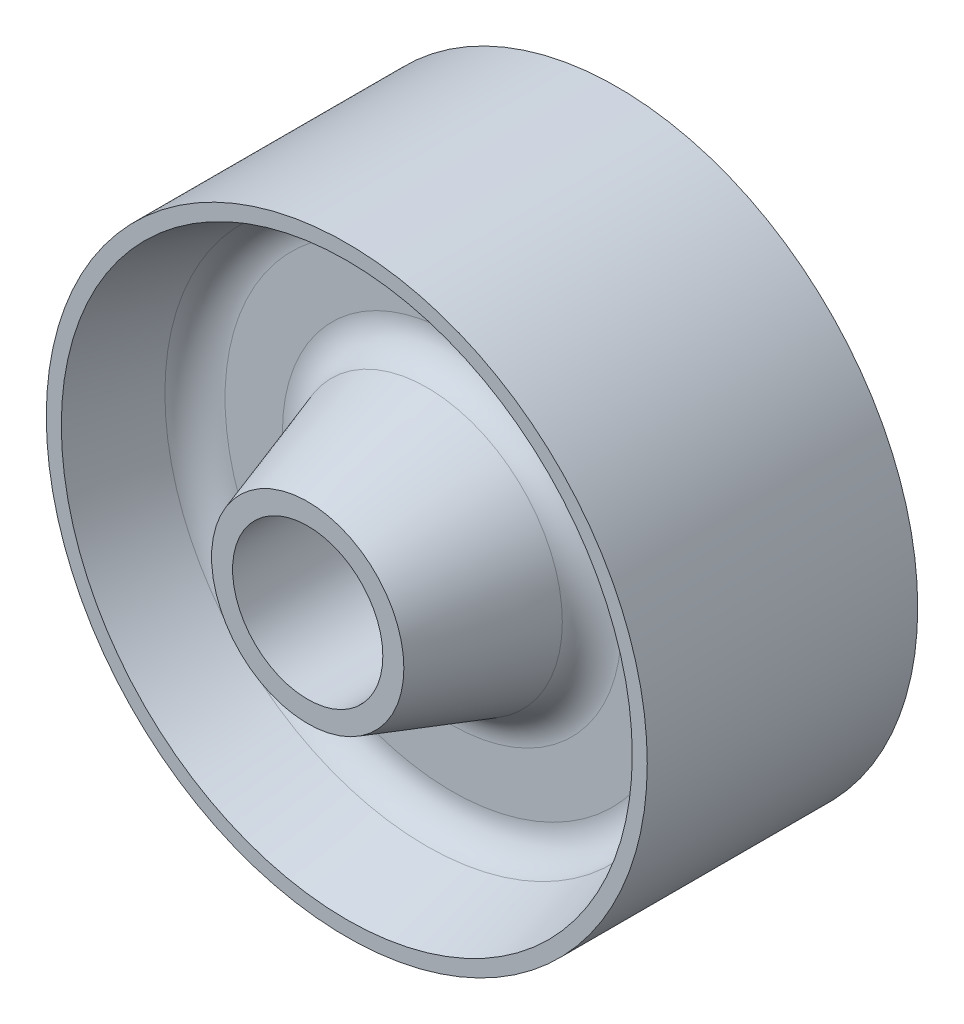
ISO-10303-21;
HEADER;
FILE_DESCRIPTION(('STEP AP214'),'2;1');
FILE_NAME('part.step','',(''),(''),'','','');
FILE_SCHEMA(('AUTOMOTIVE_DESIGN { 1 0 10303 214 1 1 1 1 }'));
ENDSEC;
DATA;
#1=APPLICATION_CONTEXT('core data for automotive mechanical design processes');
#2=APPLICATION_PROTOCOL_DEFINITION('international standard','automotive_design',2000,#1);
#3=PRODUCT_CONTEXT('',#1,'mechanical');
#4=PRODUCT('Part','Part','',(#3));
#5=PRODUCT_RELATED_PRODUCT_CATEGORY('part','',(#4));
#6=PRODUCT_DEFINITION_FORMATION('','',#4);
#7=PRODUCT_DEFINITION_CONTEXT('part definition',#1,'design');
#8=PRODUCT_DEFINITION('design','',#6,#7);
#9=PRODUCT_DEFINITION_SHAPE('','',#8);
#10=(LENGTH_UNIT() NAMED_UNIT(*) SI_UNIT(.MILLI.,.METRE.));
#11=(NAMED_UNIT(*) PLANE_ANGLE_UNIT() SI_UNIT($,.RADIAN.));
#12=(NAMED_UNIT(*) SI_UNIT($,.STERADIAN.) SOLID_ANGLE_UNIT());
#13=UNCERTAINTY_MEASURE_WITH_UNIT(LENGTH_MEASURE(1.E-05),#10,'distance_accuracy_value','');
#14=(GEOMETRIC_REPRESENTATION_CONTEXT(3) GLOBAL_UNCERTAINTY_ASSIGNED_CONTEXT((#13)) GLOBAL_UNIT_ASSIGNED_CONTEXT((#10,
#11,#12)) REPRESENTATION_CONTEXT('',''));
#15=CARTESIAN_POINT('',(0.,0.,0.));
#16=DIRECTION('',(0.,0.,1.));
#17=DIRECTION('',(1.,0.,0.));
#18=AXIS2_PLACEMENT_3D('',#15,#16,#17);
#19=CARTESIAN_POINT('',(0.,47.5,22.5));
#20=DIRECTION('',(0.,0.,-1.));
#21=DIRECTION('',(-1.,0.,0.));
#22=AXIS2_PLACEMENT_3D('',#19,#20,#21);
#23=PLANE('',#22);
#24=CARTESIAN_POINT('',(0.,0.,22.5));
#25=DIRECTION('',(0.,0.,1.));
#26=DIRECTION('',(1.,0.,0.));
#27=AXIS2_PLACEMENT_3D('',#24,#25,#26);
#28=CIRCLE('',#27,47.5);
#29=CARTESIAN_POINT('',(47.5,0.,22.5));
#30=VERTEX_POINT('',#29);
#31=EDGE_CURVE('E96',#30,#30,#28,.T.);
#32=ORIENTED_EDGE('',*,*,#31,.F.);
#33=EDGE_LOOP('',(#32));
#34=FACE_BOUND('',#33,.T.);
#35=CARTESIAN_POINT('',(0.,0.,22.5));
#36=DIRECTION('',(0.,0.,1.));
#37=DIRECTION('',(1.,0.,0.));
#38=AXIS2_PLACEMENT_3D('',#35,#36,#37);
#39=CIRCLE('',#38,50.);
#40=CARTESIAN_POINT('',(50.,0.,22.5));
#41=VERTEX_POINT('',#40);
#42=EDGE_CURVE('E12',#41,#41,#39,.T.);
#43=ORIENTED_EDGE('',*,*,#42,.T.);
#44=EDGE_LOOP('',(#43));
#45=FACE_BOUND('',#44,.T.);
#46=ADVANCED_FACE('F44',(#34,#45),#23,.F.);
#47=CARTESIAN_POINT('',(0.,0.,41.4443571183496));
#48=DIRECTION('',(0.,0.,1.));
#49=DIRECTION('',(1.,0.,0.));
#50=AXIS2_PLACEMENT_3D('',#47,#48,#49);
#51=CYLINDRICAL_SURFACE('',#50,50.);
#52=ORIENTED_EDGE('',*,*,#42,.F.);
#53=EDGE_LOOP('',(#52));
#54=FACE_BOUND('',#53,.T.);
#55=CARTESIAN_POINT('',(0.,0.,-22.4999999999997));
#56=DIRECTION('',(0.,0.,1.));
#57=DIRECTION('',(1.,0.,0.));
#58=AXIS2_PLACEMENT_3D('',#55,#56,#57);
#59=CIRCLE('',#58,50.);
#60=CARTESIAN_POINT('',(50.,0.,-22.4999999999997));
#61=VERTEX_POINT('',#60);
#62=EDGE_CURVE('E50',#61,#61,#59,.T.);
#63=ORIENTED_EDGE('',*,*,#62,.T.);
#64=EDGE_LOOP('',(#63));
#65=FACE_BOUND('',#64,.T.);
#66=ADVANCED_FACE('F103',(#54,#65),#51,.T.);
#67=CARTESIAN_POINT('',(0.,50.,-22.4999999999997));
#68=DIRECTION('',(0.,0.,1.));
#69=DIRECTION('',(1.,0.,0.));
#70=AXIS2_PLACEMENT_3D('',#67,#68,#69);
#71=PLANE('',#70);
#72=ORIENTED_EDGE('',*,*,#62,.F.);
#73=EDGE_LOOP('',(#72));
#74=FACE_BOUND('',#73,.T.);
#75=CARTESIAN_POINT('',(0.,0.,-22.4999999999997));
#76=DIRECTION('',(0.,0.,1.));
#77=DIRECTION('',(1.,0.,0.));
#78=AXIS2_PLACEMENT_3D('',#75,#76,#77);
#79=CIRCLE('',#78,47.5);
#80=CARTESIAN_POINT('',(47.5,0.,-22.4999999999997));
#81=VERTEX_POINT('',#80);
#82=EDGE_CURVE('E54',#81,#81,#79,.T.);
#83=ORIENTED_EDGE('',*,*,#82,.T.);
#84=EDGE_LOOP('',(#83));
#85=FACE_BOUND('',#84,.T.);
#86=ADVANCED_FACE('F107',(#74,#85),#71,.F.);
#87=CARTESIAN_POINT('',(0.,0.,-9.26426044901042));
#88=DIRECTION('',(0.,0.,-1.));
#89=DIRECTION('',(-1.,0.,0.));
#90=AXIS2_PLACEMENT_3D('',#87,#88,#89);
#91=CONICAL_SURFACE('',#90,43.5,0.293484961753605);
#92=ORIENTED_EDGE('',*,*,#82,.F.);
#93=EDGE_LOOP('',(#92));
#94=FACE_BOUND('',#93,.T.);
#95=CARTESIAN_POINT('',(0.,0.,-9.26426044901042));
#96=DIRECTION('',(0.,0.,1.));
#97=DIRECTION('',(1.,0.,0.));
#98=AXIS2_PLACEMENT_3D('',#95,#96,#97);
#99=CIRCLE('',#98,43.5);
#100=CARTESIAN_POINT('',(43.5,0.,-9.26426044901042));
#101=VERTEX_POINT('',#100);
#102=EDGE_CURVE('E58',#101,#101,#99,.T.);
#103=ORIENTED_EDGE('',*,*,#102,.T.);
#104=EDGE_LOOP('',(#103));
#105=FACE_BOUND('',#104,.T.);
#106=ADVANCED_FACE('F112',(#94,#105),#91,.F.);
#107=CARTESIAN_POINT('',(0.,0.,-10.9999999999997));
#108=DIRECTION('',(0.,0.,1.));
#109=DIRECTION('',(1.,0.,0.));
#110=AXIS2_PLACEMENT_3D('',#107,#108,#109);
#111=TOROIDAL_SURFACE('',#110,37.7565508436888,6.);
#112=ORIENTED_EDGE('',*,*,#102,.F.);
#113=EDGE_LOOP('',(#112));
#114=FACE_BOUND('',#113,.T.);
#115=CARTESIAN_POINT('',(0.,0.,-4.99999999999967));
#116=DIRECTION('',(0.,0.,1.));
#117=DIRECTION('',(1.,0.,0.));
#118=AXIS2_PLACEMENT_3D('',#115,#116,#117);
#119=CIRCLE('',#118,37.7565508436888);
#120=CARTESIAN_POINT('',(37.7565508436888,0.,-4.99999999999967));
#121=VERTEX_POINT('',#120);
#122=EDGE_CURVE('E63',#121,#121,#119,.T.);
#123=ORIENTED_EDGE('',*,*,#122,.T.);
#124=EDGE_LOOP('',(#123));
#125=FACE_BOUND('',#124,.T.);
#126=ADVANCED_FACE('F118',(#114,#125),#111,.F.);
#127=CARTESIAN_POINT('',(0.,37.7565508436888,-4.99999999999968));
#128=DIRECTION('',(0.,0.,1.));
#129=DIRECTION('',(1.,0.,0.));
#130=AXIS2_PLACEMENT_3D('',#127,#128,#129);
#131=PLANE('',#130);
#132=ORIENTED_EDGE('',*,*,#122,.F.);
#133=EDGE_LOOP('',(#132));
#134=FACE_BOUND('',#133,.T.);
#135=CARTESIAN_POINT('',(0.,0.,-4.99999999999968));
#136=DIRECTION('',(0.,0.,1.));
#137=DIRECTION('',(1.,0.,0.));
#138=AXIS2_PLACEMENT_3D('',#135,#136,#137);
#139=CIRCLE('',#138,28.2025139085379);
#140=CARTESIAN_POINT('',(28.2025139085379,0.,-4.99999999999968));
#141=VERTEX_POINT('',#140);
#142=EDGE_CURVE('E66',#141,#141,#139,.T.);
#143=ORIENTED_EDGE('',*,*,#142,.T.);
#144=EDGE_LOOP('',(#143));
#145=FACE_BOUND('',#144,.T.);
#146=ADVANCED_FACE('F122',(#134,#145),#131,.F.);
#147=CARTESIAN_POINT('',(0.,0.,-10.9999999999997));
#148=DIRECTION('',(0.,0.,1.));
#149=DIRECTION('',(1.,0.,0.));
#150=AXIS2_PLACEMENT_3D('',#147,#148,#149);
#151=TOROIDAL_SURFACE('',#150,28.2025139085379,6.);
#152=ORIENTED_EDGE('',*,*,#142,.F.);
#153=EDGE_LOOP('',(#152));
#154=FACE_BOUND('',#153,.T.);
#155=CARTESIAN_POINT('',(0.,0.,-9.13416637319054));
#156=DIRECTION('',(0.,0.,1.));
#157=DIRECTION('',(1.,0.,0.));
#158=AXIS2_PLACEMENT_3D('',#155,#156,#157);
#159=CIRCLE('',#158,22.5);
#160=CARTESIAN_POINT('',(22.5,0.,-9.13416637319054));
#161=VERTEX_POINT('',#160);
#162=EDGE_CURVE('E69',#161,#161,#159,.T.);
#163=ORIENTED_EDGE('',*,*,#162,.T.);
#164=EDGE_LOOP('',(#163));
#165=FACE_BOUND('',#164,.T.);
#166=ADVANCED_FACE('F126',(#154,#165),#151,.F.);
#167=CARTESIAN_POINT('',(0.,0.,-28.9999999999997));
#168=DIRECTION('',(0.,0.,1.));
#169=DIRECTION('',(1.,0.,0.));
#170=AXIS2_PLACEMENT_3D('',#167,#168,#169);
#171=CONICAL_SURFACE('',#170,16.,0.316215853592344);
#172=ORIENTED_EDGE('',*,*,#162,.F.);
#173=EDGE_LOOP('',(#172));
#174=FACE_BOUND('',#173,.T.);
#175=CARTESIAN_POINT('',(0.,0.,-28.9999999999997));
#176=DIRECTION('',(0.,0.,1.));
#177=DIRECTION('',(1.,0.,0.));
#178=AXIS2_PLACEMENT_3D('',#175,#176,#177);
#179=CIRCLE('',#178,16.);
#180=CARTESIAN_POINT('',(16.,0.,-28.9999999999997));
#181=VERTEX_POINT('',#180);
#182=EDGE_CURVE('E72',#181,#181,#179,.T.);
#183=ORIENTED_EDGE('',*,*,#182,.T.);
#184=EDGE_LOOP('',(#183));
#185=FACE_BOUND('',#184,.T.);
#186=ADVANCED_FACE('F130',(#174,#185),#171,.T.);
#187=CARTESIAN_POINT('',(0.,15.9999999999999,-28.9999999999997));
#188=DIRECTION('',(0.,0.,1.));
#189=DIRECTION('',(1.,0.,0.));
#190=AXIS2_PLACEMENT_3D('',#187,#188,#189);
#191=PLANE('',#190);
#192=ORIENTED_EDGE('',*,*,#182,.F.);
#193=EDGE_LOOP('',(#192));
#194=FACE_BOUND('',#193,.T.);
#195=CARTESIAN_POINT('',(0.,0.,-28.9999999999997));
#196=DIRECTION('',(0.,0.,1.));
#197=DIRECTION('',(1.,0.,0.));
#198=AXIS2_PLACEMENT_3D('',#195,#196,#197);
#199=CIRCLE('',#198,12.5);
#200=CARTESIAN_POINT('',(12.5,0.,-28.9999999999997));
#201=VERTEX_POINT('',#200);
#202=EDGE_CURVE('E75',#201,#201,#199,.T.);
#203=ORIENTED_EDGE('',*,*,#202,.T.);
#204=EDGE_LOOP('',(#203));
#205=FACE_BOUND('',#204,.T.);
#206=ADVANCED_FACE('F134',(#194,#205),#191,.F.);
#207=CARTESIAN_POINT('',(0.,0.,41.4443571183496));
#208=DIRECTION('',(0.,0.,1.));
#209=DIRECTION('',(1.,0.,0.));
#210=AXIS2_PLACEMENT_3D('',#207,#208,#209);
#211=CYLINDRICAL_SURFACE('',#210,12.5);
#212=ORIENTED_EDGE('',*,*,#202,.F.);
#213=EDGE_LOOP('',(#212));
#214=FACE_BOUND('',#213,.T.);
#215=CARTESIAN_POINT('',(0.,0.,29.));
#216=DIRECTION('',(0.,0.,1.));
#217=DIRECTION('',(1.,0.,0.));
#218=AXIS2_PLACEMENT_3D('',#215,#216,#217);
#219=CIRCLE('',#218,12.5);
#220=CARTESIAN_POINT('',(12.5,0.,29.));
#221=VERTEX_POINT('',#220);
#222=EDGE_CURVE('E78',#221,#221,#219,.T.);
#223=ORIENTED_EDGE('',*,*,#222,.T.);
#224=EDGE_LOOP('',(#223));
#225=FACE_BOUND('',#224,.T.);
#226=ADVANCED_FACE('F138',(#214,#225),#211,.F.);
#227=CARTESIAN_POINT('',(0.,12.4999999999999,29.));
#228=DIRECTION('',(0.,0.,-1.));
#229=DIRECTION('',(-1.,0.,0.));
#230=AXIS2_PLACEMENT_3D('',#227,#228,#229);
#231=PLANE('',#230);
#232=ORIENTED_EDGE('',*,*,#222,.F.);
#233=EDGE_LOOP('',(#232));
#234=FACE_BOUND('',#233,.T.);
#235=CARTESIAN_POINT('',(0.,0.,29.));
#236=DIRECTION('',(0.,0.,1.));
#237=DIRECTION('',(1.,0.,0.));
#238=AXIS2_PLACEMENT_3D('',#235,#236,#237);
#239=CIRCLE('',#238,16.);
#240=CARTESIAN_POINT('',(16.,0.,29.));
#241=VERTEX_POINT('',#240);
#242=EDGE_CURVE('E81',#241,#241,#239,.T.);
#243=ORIENTED_EDGE('',*,*,#242,.T.);
#244=EDGE_LOOP('',(#243));
#245=FACE_BOUND('',#244,.T.);
#246=ADVANCED_FACE('F142',(#234,#245),#231,.F.);
#247=CARTESIAN_POINT('',(0.,0.,9.13416637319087));
#248=DIRECTION('',(0.,0.,-1.));
#249=DIRECTION('',(-1.,0.,0.));
#250=AXIS2_PLACEMENT_3D('',#247,#248,#249);
#251=CONICAL_SURFACE('',#250,22.5,0.316215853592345);
#252=ORIENTED_EDGE('',*,*,#242,.F.);
#253=EDGE_LOOP('',(#252));
#254=FACE_BOUND('',#253,.T.);
#255=CARTESIAN_POINT('',(0.,0.,9.13416637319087));
#256=DIRECTION('',(0.,0.,1.));
#257=DIRECTION('',(1.,0.,0.));
#258=AXIS2_PLACEMENT_3D('',#255,#256,#257);
#259=CIRCLE('',#258,22.5);
#260=CARTESIAN_POINT('',(22.5,0.,9.13416637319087));
#261=VERTEX_POINT('',#260);
#262=EDGE_CURVE('E84',#261,#261,#259,.T.);
#263=ORIENTED_EDGE('',*,*,#262,.T.);
#264=EDGE_LOOP('',(#263));
#265=FACE_BOUND('',#264,.T.);
#266=ADVANCED_FACE('F146',(#254,#265),#251,.T.);
#267=CARTESIAN_POINT('',(0.,0.,11.));
#268=DIRECTION('',(0.,0.,1.));
#269=DIRECTION('',(1.,0.,0.));
#270=AXIS2_PLACEMENT_3D('',#267,#268,#269);
#271=TOROIDAL_SURFACE('',#270,28.2025139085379,6.);
#272=ORIENTED_EDGE('',*,*,#262,.F.);
#273=EDGE_LOOP('',(#272));
#274=FACE_BOUND('',#273,.T.);
#275=CARTESIAN_POINT('',(0.,0.,5.));
#276=DIRECTION('',(0.,0.,1.));
#277=DIRECTION('',(1.,0.,0.));
#278=AXIS2_PLACEMENT_3D('',#275,#276,#277);
#279=CIRCLE('',#278,28.2025139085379);
#280=CARTESIAN_POINT('',(28.2025139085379,0.,5.));
#281=VERTEX_POINT('',#280);
#282=EDGE_CURVE('E87',#281,#281,#279,.T.);
#283=ORIENTED_EDGE('',*,*,#282,.T.);
#284=EDGE_LOOP('',(#283));
#285=FACE_BOUND('',#284,.T.);
#286=ADVANCED_FACE('F150',(#274,#285),#271,.F.);
#287=CARTESIAN_POINT('',(0.,28.2025139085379,5.));
#288=DIRECTION('',(0.,0.,-1.));
#289=DIRECTION('',(-1.,0.,0.));
#290=AXIS2_PLACEMENT_3D('',#287,#288,#289);
#291=PLANE('',#290);
#292=ORIENTED_EDGE('',*,*,#282,.F.);
#293=EDGE_LOOP('',(#292));
#294=FACE_BOUND('',#293,.T.);
#295=CARTESIAN_POINT('',(0.,0.,5.));
#296=DIRECTION('',(0.,0.,1.));
#297=DIRECTION('',(1.,0.,0.));
#298=AXIS2_PLACEMENT_3D('',#295,#296,#297);
#299=CIRCLE('',#298,37.7565508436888);
#300=CARTESIAN_POINT('',(37.7565508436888,0.,5.));
#301=VERTEX_POINT('',#300);
#302=EDGE_CURVE('E90',#301,#301,#299,.T.);
#303=ORIENTED_EDGE('',*,*,#302,.T.);
#304=EDGE_LOOP('',(#303));
#305=FACE_BOUND('',#304,.T.);
#306=ADVANCED_FACE('F154',(#294,#305),#291,.F.);
#307=CARTESIAN_POINT('',(0.,0.,11.));
#308=DIRECTION('',(0.,0.,1.));
#309=DIRECTION('',(1.,0.,0.));
#310=AXIS2_PLACEMENT_3D('',#307,#308,#309);
#311=TOROIDAL_SURFACE('',#310,37.7565508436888,6.);
#312=ORIENTED_EDGE('',*,*,#302,.F.);
#313=EDGE_LOOP('',(#312));
#314=FACE_BOUND('',#313,.T.);
#315=CARTESIAN_POINT('',(0.,0.,9.26426044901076));
#316=DIRECTION('',(0.,0.,1.));
#317=DIRECTION('',(1.,0.,0.));
#318=AXIS2_PLACEMENT_3D('',#315,#316,#317);
#319=CIRCLE('',#318,43.5);
#320=CARTESIAN_POINT('',(43.5,0.,9.26426044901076));
#321=VERTEX_POINT('',#320);
#322=EDGE_CURVE('E93',#321,#321,#319,.T.);
#323=ORIENTED_EDGE('',*,*,#322,.T.);
#324=EDGE_LOOP('',(#323));
#325=FACE_BOUND('',#324,.T.);
#326=ADVANCED_FACE('F158',(#314,#325),#311,.F.);
#327=CARTESIAN_POINT('',(0.,0.,22.5));
#328=DIRECTION('',(0.,0.,1.));
#329=DIRECTION('',(1.,0.,0.));
#330=AXIS2_PLACEMENT_3D('',#327,#328,#329);
#331=CONICAL_SURFACE('',#330,47.5,0.293484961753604);
#332=ORIENTED_EDGE('',*,*,#322,.F.);
#333=EDGE_LOOP('',(#332));
#334=FACE_BOUND('',#333,.T.);
#335=ORIENTED_EDGE('',*,*,#31,.T.);
#336=EDGE_LOOP('',(#335));
#337=FACE_BOUND('',#336,.T.);
#338=ADVANCED_FACE('F100',(#334,#337),#331,.F.);
#339=CLOSED_SHELL('',(#46,#66,#86,#106,#126,#146,#166,#186,#206,#226,#246,#266,#286,#306,#326,#338));
#340=MANIFOLD_SOLID_BREP('B2',#339);
#341=ADVANCED_BREP_SHAPE_REPRESENTATION('',(#18,#340),#14);
#342=SHAPE_DEFINITION_REPRESENTATION(#9,#341);
ENDSEC;
END-ISO-10303-21;
